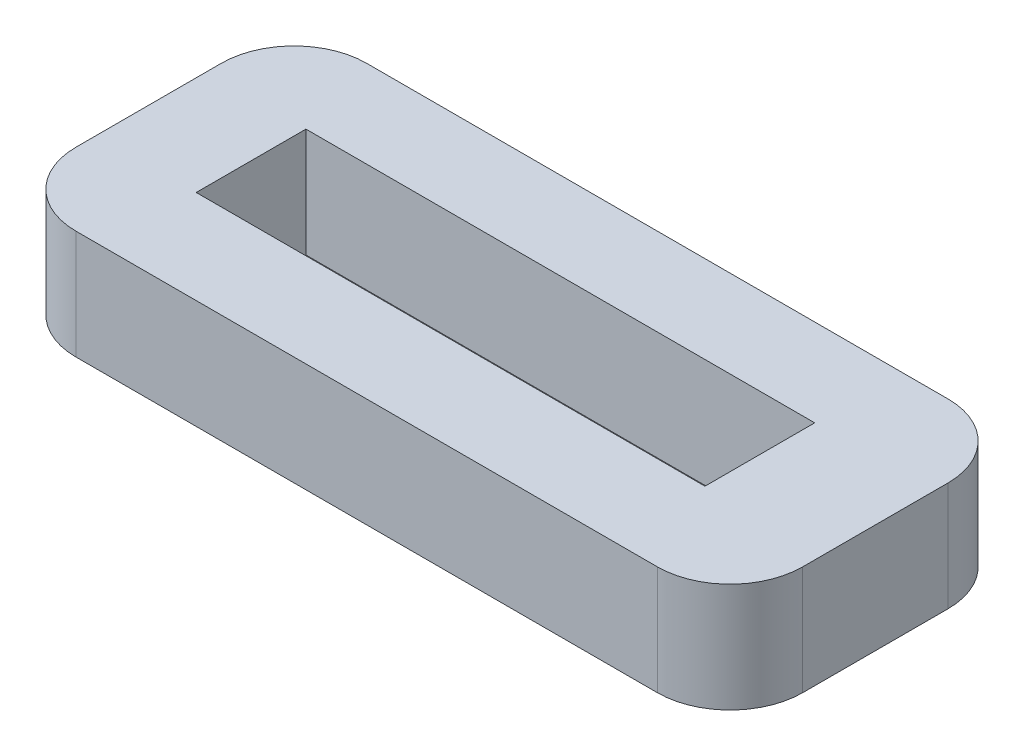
ISO-10303-21;
HEADER;
FILE_DESCRIPTION(('STEP AP214'),'2;1');
FILE_NAME('part.step','',(''),(''),'','','');
FILE_SCHEMA(('AUTOMOTIVE_DESIGN { 1 0 10303 214 1 1 1 1 }'));
ENDSEC;
DATA;
#1=APPLICATION_CONTEXT('core data for automotive mechanical design processes');
#2=APPLICATION_PROTOCOL_DEFINITION('international standard','automotive_design',2000,#1);
#3=PRODUCT_CONTEXT('',#1,'mechanical');
#4=PRODUCT('Part','Part','',(#3));
#5=PRODUCT_RELATED_PRODUCT_CATEGORY('part','',(#4));
#6=PRODUCT_DEFINITION_FORMATION('','',#4);
#7=PRODUCT_DEFINITION_CONTEXT('part definition',#1,'design');
#8=PRODUCT_DEFINITION('design','',#6,#7);
#9=PRODUCT_DEFINITION_SHAPE('','',#8);
#10=(LENGTH_UNIT() NAMED_UNIT(*) SI_UNIT(.MILLI.,.METRE.));
#11=(NAMED_UNIT(*) PLANE_ANGLE_UNIT() SI_UNIT($,.RADIAN.));
#12=(NAMED_UNIT(*) SI_UNIT($,.STERADIAN.) SOLID_ANGLE_UNIT());
#13=UNCERTAINTY_MEASURE_WITH_UNIT(LENGTH_MEASURE(1.E-05),#10,'distance_accuracy_value','');
#14=(GEOMETRIC_REPRESENTATION_CONTEXT(3) GLOBAL_UNCERTAINTY_ASSIGNED_CONTEXT((#13)) GLOBAL_UNIT_ASSIGNED_CONTEXT((#10,
#11,#12)) REPRESENTATION_CONTEXT('',''));
#15=CARTESIAN_POINT('',(0.,0.,0.));
#16=DIRECTION('',(0.,0.,1.));
#17=DIRECTION('',(1.,0.,0.));
#18=AXIS2_PLACEMENT_3D('',#15,#16,#17);
#19=CARTESIAN_POINT('',(-85.3775510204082,7.5,-11.2632653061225));
#20=DIRECTION('',(0.,1.,0.));
#21=DIRECTION('',(0.,0.,1.));
#22=AXIS2_PLACEMENT_3D('',#19,#20,#21);
#23=PLANE('',#22);
#24=CARTESIAN_POINT('',(-85.3775510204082,7.5,-11.2632653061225));
#25=DIRECTION('',(0.,1.,0.));
#26=DIRECTION('',(0.,0.,1.));
#27=AXIS2_PLACEMENT_3D('',#24,#25,#26);
#28=CIRCLE('',#27,10.);
#29=CARTESIAN_POINT('',(-85.3775510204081,7.5,-21.2632653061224));
#30=VERTEX_POINT('',#29);
#31=CARTESIAN_POINT('',(-95.3775510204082,7.5,-11.2632653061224));
#32=VERTEX_POINT('',#31);
#33=EDGE_CURVE('E158',#30,#32,#28,.T.);
#34=ORIENTED_EDGE('',*,*,#33,.T.);
#35=DIRECTION('',(0.,0.,1.));
#36=VECTOR('',#35,1.);
#37=CARTESIAN_POINT('',(-95.3775510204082,7.5,-11.2632653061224));
#38=LINE('',#37,#36);
#39=CARTESIAN_POINT('',(-95.3775510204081,7.5,8.73673469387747));
#40=VERTEX_POINT('',#39);
#41=EDGE_CURVE('E161',#32,#40,#38,.T.);
#42=ORIENTED_EDGE('',*,*,#41,.T.);
#43=CARTESIAN_POINT('',(-85.3775510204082,7.5,8.73673469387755));
#44=DIRECTION('',(0.,1.,0.));
#45=DIRECTION('',(0.,0.,1.));
#46=AXIS2_PLACEMENT_3D('',#43,#44,#45);
#47=CIRCLE('',#46,10.);
#48=CARTESIAN_POINT('',(-85.3775510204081,7.5,18.7367346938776));
#49=VERTEX_POINT('',#48);
#50=EDGE_CURVE('E164',#40,#49,#47,.T.);
#51=ORIENTED_EDGE('',*,*,#50,.T.);
#52=DIRECTION('',(1.,0.,0.));
#53=VECTOR('',#52,1.);
#54=CARTESIAN_POINT('',(-85.3775510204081,7.5,18.7367346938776));
#55=LINE('',#54,#53);
#56=CARTESIAN_POINT('',(-5.37755102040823,7.5,18.7367346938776));
#57=VERTEX_POINT('',#56);
#58=EDGE_CURVE('E166',#49,#57,#55,.T.);
#59=ORIENTED_EDGE('',*,*,#58,.T.);
#60=CARTESIAN_POINT('',(-5.37755102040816,7.5,8.73673469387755));
#61=DIRECTION('',(0.,1.,0.));
#62=DIRECTION('',(0.,0.,1.));
#63=AXIS2_PLACEMENT_3D('',#60,#61,#62);
#64=CIRCLE('',#63,10.);
#65=CARTESIAN_POINT('',(4.62244897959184,7.5,8.73673469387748));
#66=VERTEX_POINT('',#65);
#67=EDGE_CURVE('E168',#57,#66,#64,.T.);
#68=ORIENTED_EDGE('',*,*,#67,.T.);
#69=DIRECTION('',(0.,0.,-1.));
#70=VECTOR('',#69,1.);
#71=CARTESIAN_POINT('',(4.62244897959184,7.5,-11.2632653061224));
#72=LINE('',#71,#70);
#73=CARTESIAN_POINT('',(4.62244897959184,7.5,-11.2632653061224));
#74=VERTEX_POINT('',#73);
#75=EDGE_CURVE('E170',#66,#74,#72,.T.);
#76=ORIENTED_EDGE('',*,*,#75,.T.);
#77=CARTESIAN_POINT('',(-5.37755102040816,7.5,-11.2632653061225));
#78=DIRECTION('',(0.,1.,0.));
#79=DIRECTION('',(0.,0.,-1.));
#80=AXIS2_PLACEMENT_3D('',#77,#78,#79);
#81=CIRCLE('',#80,10.);
#82=CARTESIAN_POINT('',(-5.37755102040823,7.5,-21.2632653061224));
#83=VERTEX_POINT('',#82);
#84=EDGE_CURVE('E172',#74,#83,#81,.T.);
#85=ORIENTED_EDGE('',*,*,#84,.T.);
#86=DIRECTION('',(-1.,0.,0.));
#87=VECTOR('',#86,1.);
#88=CARTESIAN_POINT('',(-85.3775510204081,7.5,-21.2632653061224));
#89=LINE('',#88,#87);
#90=EDGE_CURVE('E174',#83,#30,#89,.T.);
#91=ORIENTED_EDGE('',*,*,#90,.T.);
#92=EDGE_LOOP('',(#34,#42,#51,#59,#68,#76,#85,#91));
#93=FACE_BOUND('',#92,.T.);
#94=DIRECTION('',(1.,0.,0.));
#95=VECTOR('',#94,1.);
#96=CARTESIAN_POINT('',(-81.7102040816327,7.5,5.85510204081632));
#97=LINE('',#96,#95);
#98=CARTESIAN_POINT('',(-81.7102040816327,7.5,5.85510204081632));
#99=VERTEX_POINT('',#98);
#100=CARTESIAN_POINT('',(-11.7102040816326,7.5,5.85510204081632));
#101=VERTEX_POINT('',#100);
#102=EDGE_CURVE('E130',#99,#101,#97,.T.);
#103=ORIENTED_EDGE('',*,*,#102,.F.);
#104=DIRECTION('',(0.,0.,1.));
#105=VECTOR('',#104,1.);
#106=CARTESIAN_POINT('',(-81.7102040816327,7.5,-9.24489795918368));
#107=LINE('',#106,#105);
#108=CARTESIAN_POINT('',(-81.7102040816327,7.5,-9.24489795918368));
#109=VERTEX_POINT('',#108);
#110=EDGE_CURVE('E122',#109,#99,#107,.T.);
#111=ORIENTED_EDGE('',*,*,#110,.F.);
#112=DIRECTION('',(-1.,0.,0.));
#113=VECTOR('',#112,1.);
#114=CARTESIAN_POINT('',(-81.7102040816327,7.5,-9.24489795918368));
#115=LINE('',#114,#113);
#116=CARTESIAN_POINT('',(-11.7102040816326,7.5,-9.24489795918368));
#117=VERTEX_POINT('',#116);
#118=EDGE_CURVE('E144',#117,#109,#115,.T.);
#119=ORIENTED_EDGE('',*,*,#118,.F.);
#120=DIRECTION('',(0.,0.,-1.));
#121=VECTOR('',#120,1.);
#122=CARTESIAN_POINT('',(-11.7102040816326,7.5,-9.24489795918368));
#123=LINE('',#122,#121);
#124=EDGE_CURVE('E142',#101,#117,#123,.T.);
#125=ORIENTED_EDGE('',*,*,#124,.F.);
#126=EDGE_LOOP('',(#103,#111,#119,#125));
#127=FACE_BOUND('',#126,.T.);
#128=ADVANCED_FACE('F33',(#93,#127),#23,.T.);
#129=CARTESIAN_POINT('',(-85.3775510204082,-7.5,-11.2632653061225));
#130=DIRECTION('',(0.,1.,0.));
#131=DIRECTION('',(0.,0.,1.));
#132=AXIS2_PLACEMENT_3D('',#129,#130,#131);
#133=PLANE('',#132);
#134=CARTESIAN_POINT('',(-85.3775510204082,-7.5,-11.2632653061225));
#135=DIRECTION('',(0.,1.,0.));
#136=DIRECTION('',(0.,0.,1.));
#137=AXIS2_PLACEMENT_3D('',#134,#135,#136);
#138=CIRCLE('',#137,10.);
#139=CARTESIAN_POINT('',(-85.3775510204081,-7.5,-21.2632653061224));
#140=VERTEX_POINT('',#139);
#141=CARTESIAN_POINT('',(-95.3775510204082,-7.5,-11.2632653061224));
#142=VERTEX_POINT('',#141);
#143=EDGE_CURVE('E138',#140,#142,#138,.T.);
#144=ORIENTED_EDGE('',*,*,#143,.F.);
#145=DIRECTION('',(-1.,0.,0.));
#146=VECTOR('',#145,1.);
#147=CARTESIAN_POINT('',(-85.3775510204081,-7.5,-21.2632653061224));
#148=LINE('',#147,#146);
#149=CARTESIAN_POINT('',(-5.37755102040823,-7.5,-21.2632653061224));
#150=VERTEX_POINT('',#149);
#151=EDGE_CURVE('E162',#150,#140,#148,.T.);
#152=ORIENTED_EDGE('',*,*,#151,.F.);
#153=CARTESIAN_POINT('',(-5.37755102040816,-7.5,-11.2632653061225));
#154=DIRECTION('',(0.,1.,0.));
#155=DIRECTION('',(0.,0.,-1.));
#156=AXIS2_PLACEMENT_3D('',#153,#154,#155);
#157=CIRCLE('',#156,10.);
#158=CARTESIAN_POINT('',(4.62244897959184,-7.5,-11.2632653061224));
#159=VERTEX_POINT('',#158);
#160=EDGE_CURVE('E189',#159,#150,#157,.T.);
#161=ORIENTED_EDGE('',*,*,#160,.F.);
#162=DIRECTION('',(0.,0.,-1.));
#163=VECTOR('',#162,1.);
#164=CARTESIAN_POINT('',(4.62244897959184,-7.5,-11.2632653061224));
#165=LINE('',#164,#163);
#166=CARTESIAN_POINT('',(4.62244897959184,-7.5,8.73673469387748));
#167=VERTEX_POINT('',#166);
#168=EDGE_CURVE('E187',#167,#159,#165,.T.);
#169=ORIENTED_EDGE('',*,*,#168,.F.);
#170=CARTESIAN_POINT('',(-5.37755102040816,-7.5,8.73673469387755));
#171=DIRECTION('',(0.,1.,0.));
#172=DIRECTION('',(0.,0.,1.));
#173=AXIS2_PLACEMENT_3D('',#170,#171,#172);
#174=CIRCLE('',#173,10.);
#175=CARTESIAN_POINT('',(-5.37755102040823,-7.5,18.7367346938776));
#176=VERTEX_POINT('',#175);
#177=EDGE_CURVE('E185',#176,#167,#174,.T.);
#178=ORIENTED_EDGE('',*,*,#177,.F.);
#179=DIRECTION('',(1.,0.,0.));
#180=VECTOR('',#179,1.);
#181=CARTESIAN_POINT('',(-85.3775510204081,-7.5,18.7367346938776));
#182=LINE('',#181,#180);
#183=CARTESIAN_POINT('',(-85.3775510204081,-7.5,18.7367346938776));
#184=VERTEX_POINT('',#183);
#185=EDGE_CURVE('E183',#184,#176,#182,.T.);
#186=ORIENTED_EDGE('',*,*,#185,.F.);
#187=CARTESIAN_POINT('',(-85.3775510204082,-7.5,8.73673469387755));
#188=DIRECTION('',(0.,1.,0.));
#189=DIRECTION('',(0.,0.,1.));
#190=AXIS2_PLACEMENT_3D('',#187,#188,#189);
#191=CIRCLE('',#190,10.);
#192=CARTESIAN_POINT('',(-95.3775510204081,-7.5,8.73673469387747));
#193=VERTEX_POINT('',#192);
#194=EDGE_CURVE('E181',#193,#184,#191,.T.);
#195=ORIENTED_EDGE('',*,*,#194,.F.);
#196=DIRECTION('',(0.,0.,1.));
#197=VECTOR('',#196,1.);
#198=CARTESIAN_POINT('',(-95.3775510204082,-7.5,-11.2632653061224));
#199=LINE('',#198,#197);
#200=EDGE_CURVE('E179',#142,#193,#199,.T.);
#201=ORIENTED_EDGE('',*,*,#200,.F.);
#202=EDGE_LOOP('',(#144,#152,#161,#169,#178,#186,#195,#201));
#203=FACE_BOUND('',#202,.T.);
#204=DIRECTION('',(0.,0.,1.));
#205=VECTOR('',#204,1.);
#206=CARTESIAN_POINT('',(-81.7102040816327,-7.5,-9.24489795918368));
#207=LINE('',#206,#205);
#208=CARTESIAN_POINT('',(-81.7102040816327,-7.5,-9.24489795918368));
#209=VERTEX_POINT('',#208);
#210=CARTESIAN_POINT('',(-81.7102040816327,-7.5,5.85510204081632));
#211=VERTEX_POINT('',#210);
#212=EDGE_CURVE('E56',#209,#211,#207,.T.);
#213=ORIENTED_EDGE('',*,*,#212,.T.);
#214=DIRECTION('',(1.,0.,0.));
#215=VECTOR('',#214,1.);
#216=CARTESIAN_POINT('',(-81.7102040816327,-7.5,5.85510204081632));
#217=LINE('',#216,#215);
#218=CARTESIAN_POINT('',(-11.7102040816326,-7.5,5.85510204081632));
#219=VERTEX_POINT('',#218);
#220=EDGE_CURVE('E137',#211,#219,#217,.T.);
#221=ORIENTED_EDGE('',*,*,#220,.T.);
#222=DIRECTION('',(0.,0.,-1.));
#223=VECTOR('',#222,1.);
#224=CARTESIAN_POINT('',(-11.7102040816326,-7.5,-9.24489795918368));
#225=LINE('',#224,#223);
#226=CARTESIAN_POINT('',(-11.7102040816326,-7.5,-9.24489795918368));
#227=VERTEX_POINT('',#226);
#228=EDGE_CURVE('E150',#219,#227,#225,.T.);
#229=ORIENTED_EDGE('',*,*,#228,.T.);
#230=DIRECTION('',(-1.,0.,0.));
#231=VECTOR('',#230,1.);
#232=CARTESIAN_POINT('',(-81.7102040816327,-7.5,-9.24489795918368));
#233=LINE('',#232,#231);
#234=EDGE_CURVE('E131',#227,#209,#233,.T.);
#235=ORIENTED_EDGE('',*,*,#234,.T.);
#236=EDGE_LOOP('',(#213,#221,#229,#235));
#237=FACE_BOUND('',#236,.T.);
#238=ADVANCED_FACE('F219',(#203,#237),#133,.F.);
#239=CARTESIAN_POINT('',(-85.3775510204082,7.5,-11.2632653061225));
#240=DIRECTION('',(0.,-1.,0.));
#241=DIRECTION('',(0.,0.,-1.));
#242=AXIS2_PLACEMENT_3D('',#239,#240,#241);
#243=CYLINDRICAL_SURFACE('',#242,10.);
#244=ORIENTED_EDGE('',*,*,#143,.T.);
#245=DIRECTION('',(0.,-1.,0.));
#246=VECTOR('',#245,1.);
#247=CARTESIAN_POINT('',(-95.3775510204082,7.5,-11.2632653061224));
#248=LINE('',#247,#246);
#249=EDGE_CURVE('E11',#32,#142,#248,.T.);
#250=ORIENTED_EDGE('',*,*,#249,.F.);
#251=ORIENTED_EDGE('',*,*,#33,.F.);
#252=DIRECTION('',(0.,-1.,0.));
#253=VECTOR('',#252,1.);
#254=CARTESIAN_POINT('',(-85.3775510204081,7.5,-21.2632653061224));
#255=LINE('',#254,#253);
#256=EDGE_CURVE('E176',#30,#140,#255,.T.);
#257=ORIENTED_EDGE('',*,*,#256,.T.);
#258=EDGE_LOOP('',(#244,#250,#251,#257));
#259=FACE_BOUND('',#258,.T.);
#260=ADVANCED_FACE('F35',(#259),#243,.T.);
#261=CARTESIAN_POINT('',(-95.3775510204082,7.5,-11.2632653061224));
#262=DIRECTION('',(1.,0.,0.));
#263=DIRECTION('',(0.,0.,-1.));
#264=AXIS2_PLACEMENT_3D('',#261,#262,#263);
#265=PLANE('',#264);
#266=ORIENTED_EDGE('',*,*,#200,.T.);
#267=DIRECTION('',(0.,-1.,0.));
#268=VECTOR('',#267,1.);
#269=CARTESIAN_POINT('',(-95.3775510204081,7.5,8.73673469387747));
#270=LINE('',#269,#268);
#271=EDGE_CURVE('E41',#40,#193,#270,.T.);
#272=ORIENTED_EDGE('',*,*,#271,.F.);
#273=ORIENTED_EDGE('',*,*,#41,.F.);
#274=ORIENTED_EDGE('',*,*,#249,.T.);
#275=EDGE_LOOP('',(#266,#272,#273,#274));
#276=FACE_BOUND('',#275,.T.);
#277=ADVANCED_FACE('F236',(#276),#265,.F.);
#278=CARTESIAN_POINT('',(-85.3775510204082,7.5,8.73673469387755));
#279=DIRECTION('',(0.,-1.,0.));
#280=DIRECTION('',(0.,0.,-1.));
#281=AXIS2_PLACEMENT_3D('',#278,#279,#280);
#282=CYLINDRICAL_SURFACE('',#281,10.);
#283=ORIENTED_EDGE('',*,*,#194,.T.);
#284=DIRECTION('',(0.,-1.,0.));
#285=VECTOR('',#284,1.);
#286=CARTESIAN_POINT('',(-85.3775510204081,7.5,18.7367346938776));
#287=LINE('',#286,#285);
#288=EDGE_CURVE('E206',#49,#184,#287,.T.);
#289=ORIENTED_EDGE('',*,*,#288,.F.);
#290=ORIENTED_EDGE('',*,*,#50,.F.);
#291=ORIENTED_EDGE('',*,*,#271,.T.);
#292=EDGE_LOOP('',(#283,#289,#290,#291));
#293=FACE_BOUND('',#292,.T.);
#294=ADVANCED_FACE('F213',(#293),#282,.T.);
#295=CARTESIAN_POINT('',(-85.3775510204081,7.5,18.7367346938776));
#296=DIRECTION('',(0.,0.,-1.));
#297=DIRECTION('',(-1.,0.,0.));
#298=AXIS2_PLACEMENT_3D('',#295,#296,#297);
#299=PLANE('',#298);
#300=ORIENTED_EDGE('',*,*,#185,.T.);
#301=DIRECTION('',(0.,-1.,0.));
#302=VECTOR('',#301,1.);
#303=CARTESIAN_POINT('',(-5.37755102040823,7.5,18.7367346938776));
#304=LINE('',#303,#302);
#305=EDGE_CURVE('E203',#57,#176,#304,.T.);
#306=ORIENTED_EDGE('',*,*,#305,.F.);
#307=ORIENTED_EDGE('',*,*,#58,.F.);
#308=ORIENTED_EDGE('',*,*,#288,.T.);
#309=EDGE_LOOP('',(#300,#306,#307,#308));
#310=FACE_BOUND('',#309,.T.);
#311=ADVANCED_FACE('F225',(#310),#299,.F.);
#312=CARTESIAN_POINT('',(-5.37755102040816,7.5,8.73673469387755));
#313=DIRECTION('',(0.,-1.,0.));
#314=DIRECTION('',(0.,0.,-1.));
#315=AXIS2_PLACEMENT_3D('',#312,#313,#314);
#316=CYLINDRICAL_SURFACE('',#315,10.);
#317=ORIENTED_EDGE('',*,*,#177,.T.);
#318=DIRECTION('',(0.,-1.,0.));
#319=VECTOR('',#318,1.);
#320=CARTESIAN_POINT('',(4.62244897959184,7.5,8.73673469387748));
#321=LINE('',#320,#319);
#322=EDGE_CURVE('E200',#66,#167,#321,.T.);
#323=ORIENTED_EDGE('',*,*,#322,.F.);
#324=ORIENTED_EDGE('',*,*,#67,.F.);
#325=ORIENTED_EDGE('',*,*,#305,.T.);
#326=EDGE_LOOP('',(#317,#323,#324,#325));
#327=FACE_BOUND('',#326,.T.);
#328=ADVANCED_FACE('F229',(#327),#316,.T.);
#329=CARTESIAN_POINT('',(4.62244897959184,7.5,-11.2632653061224));
#330=DIRECTION('',(-1.,0.,0.));
#331=DIRECTION('',(0.,0.,1.));
#332=AXIS2_PLACEMENT_3D('',#329,#330,#331);
#333=PLANE('',#332);
#334=ORIENTED_EDGE('',*,*,#168,.T.);
#335=DIRECTION('',(0.,-1.,0.));
#336=VECTOR('',#335,1.);
#337=CARTESIAN_POINT('',(4.62244897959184,7.5,-11.2632653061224));
#338=LINE('',#337,#336);
#339=EDGE_CURVE('E197',#74,#159,#338,.T.);
#340=ORIENTED_EDGE('',*,*,#339,.F.);
#341=ORIENTED_EDGE('',*,*,#75,.F.);
#342=ORIENTED_EDGE('',*,*,#322,.T.);
#343=EDGE_LOOP('',(#334,#340,#341,#342));
#344=FACE_BOUND('',#343,.T.);
#345=ADVANCED_FACE('F249',(#344),#333,.F.);
#346=CARTESIAN_POINT('',(-5.37755102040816,7.5,-11.2632653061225));
#347=DIRECTION('',(0.,-1.,0.));
#348=DIRECTION('',(0.,0.,-1.));
#349=AXIS2_PLACEMENT_3D('',#346,#347,#348);
#350=CYLINDRICAL_SURFACE('',#349,10.);
#351=ORIENTED_EDGE('',*,*,#160,.T.);
#352=DIRECTION('',(0.,-1.,0.));
#353=VECTOR('',#352,1.);
#354=CARTESIAN_POINT('',(-5.37755102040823,7.5,-21.2632653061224));
#355=LINE('',#354,#353);
#356=EDGE_CURVE('E194',#83,#150,#355,.T.);
#357=ORIENTED_EDGE('',*,*,#356,.F.);
#358=ORIENTED_EDGE('',*,*,#84,.F.);
#359=ORIENTED_EDGE('',*,*,#339,.T.);
#360=EDGE_LOOP('',(#351,#357,#358,#359));
#361=FACE_BOUND('',#360,.T.);
#362=ADVANCED_FACE('F247',(#361),#350,.T.);
#363=CARTESIAN_POINT('',(-85.3775510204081,7.5,-21.2632653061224));
#364=DIRECTION('',(0.,0.,1.));
#365=DIRECTION('',(1.,0.,0.));
#366=AXIS2_PLACEMENT_3D('',#363,#364,#365);
#367=PLANE('',#366);
#368=ORIENTED_EDGE('',*,*,#151,.T.);
#369=ORIENTED_EDGE('',*,*,#256,.F.);
#370=ORIENTED_EDGE('',*,*,#90,.F.);
#371=ORIENTED_EDGE('',*,*,#356,.T.);
#372=EDGE_LOOP('',(#368,#369,#370,#371));
#373=FACE_BOUND('',#372,.T.);
#374=ADVANCED_FACE('F242',(#373),#367,.F.);
#375=CARTESIAN_POINT('',(-81.7102040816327,7.5,-9.24489795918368));
#376=DIRECTION('',(1.,0.,0.));
#377=DIRECTION('',(0.,0.,-1.));
#378=AXIS2_PLACEMENT_3D('',#375,#376,#377);
#379=PLANE('',#378);
#380=ORIENTED_EDGE('',*,*,#212,.F.);
#381=DIRECTION('',(0.,-1.,0.));
#382=VECTOR('',#381,1.);
#383=CARTESIAN_POINT('',(-81.7102040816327,7.5,-9.24489795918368));
#384=LINE('',#383,#382);
#385=EDGE_CURVE('E126',#109,#209,#384,.T.);
#386=ORIENTED_EDGE('',*,*,#385,.F.);
#387=ORIENTED_EDGE('',*,*,#110,.T.);
#388=DIRECTION('',(0.,-1.,0.));
#389=VECTOR('',#388,1.);
#390=CARTESIAN_POINT('',(-81.7102040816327,7.5,5.85510204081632));
#391=LINE('',#390,#389);
#392=EDGE_CURVE('E125',#99,#211,#391,.T.);
#393=ORIENTED_EDGE('',*,*,#392,.T.);
#394=EDGE_LOOP('',(#380,#386,#387,#393));
#395=FACE_BOUND('',#394,.T.);
#396=ADVANCED_FACE('F124',(#395),#379,.T.);
#397=CARTESIAN_POINT('',(-81.7102040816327,7.5,5.85510204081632));
#398=DIRECTION('',(0.,0.,-1.));
#399=DIRECTION('',(-1.,0.,0.));
#400=AXIS2_PLACEMENT_3D('',#397,#398,#399);
#401=PLANE('',#400);
#402=ORIENTED_EDGE('',*,*,#220,.F.);
#403=ORIENTED_EDGE('',*,*,#392,.F.);
#404=ORIENTED_EDGE('',*,*,#102,.T.);
#405=DIRECTION('',(0.,-1.,0.));
#406=VECTOR('',#405,1.);
#407=CARTESIAN_POINT('',(-11.7102040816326,7.5,5.85510204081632));
#408=LINE('',#407,#406);
#409=EDGE_CURVE('E139',#101,#219,#408,.T.);
#410=ORIENTED_EDGE('',*,*,#409,.T.);
#411=EDGE_LOOP('',(#402,#403,#404,#410));
#412=FACE_BOUND('',#411,.T.);
#413=ADVANCED_FACE('F134',(#412),#401,.T.);
#414=CARTESIAN_POINT('',(-11.7102040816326,7.5,-9.24489795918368));
#415=DIRECTION('',(-1.,0.,0.));
#416=DIRECTION('',(0.,0.,1.));
#417=AXIS2_PLACEMENT_3D('',#414,#415,#416);
#418=PLANE('',#417);
#419=ORIENTED_EDGE('',*,*,#228,.F.);
#420=ORIENTED_EDGE('',*,*,#409,.F.);
#421=ORIENTED_EDGE('',*,*,#124,.T.);
#422=DIRECTION('',(0.,-1.,0.));
#423=VECTOR('',#422,1.);
#424=CARTESIAN_POINT('',(-11.7102040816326,7.5,-9.24489795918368));
#425=LINE('',#424,#423);
#426=EDGE_CURVE('E48',#117,#227,#425,.T.);
#427=ORIENTED_EDGE('',*,*,#426,.T.);
#428=EDGE_LOOP('',(#419,#420,#421,#427));
#429=FACE_BOUND('',#428,.T.);
#430=ADVANCED_FACE('F274',(#429),#418,.T.);
#431=CARTESIAN_POINT('',(-81.7102040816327,7.5,-9.24489795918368));
#432=DIRECTION('',(0.,0.,1.));
#433=DIRECTION('',(1.,0.,0.));
#434=AXIS2_PLACEMENT_3D('',#431,#432,#433);
#435=PLANE('',#434);
#436=ORIENTED_EDGE('',*,*,#234,.F.);
#437=ORIENTED_EDGE('',*,*,#426,.F.);
#438=ORIENTED_EDGE('',*,*,#118,.T.);
#439=ORIENTED_EDGE('',*,*,#385,.T.);
#440=EDGE_LOOP('',(#436,#437,#438,#439));
#441=FACE_BOUND('',#440,.T.);
#442=ADVANCED_FACE('F278',(#441),#435,.T.);
#443=CLOSED_SHELL('',(#128,#238,#260,#277,#294,#311,#328,#345,#362,#374,#396,#413,#430,#442));
#444=MANIFOLD_SOLID_BREP('B2',#443);
#445=ADVANCED_BREP_SHAPE_REPRESENTATION('',(#18,#444),#14);
#446=SHAPE_DEFINITION_REPRESENTATION(#9,#445);
ENDSEC;
END-ISO-10303-21;
